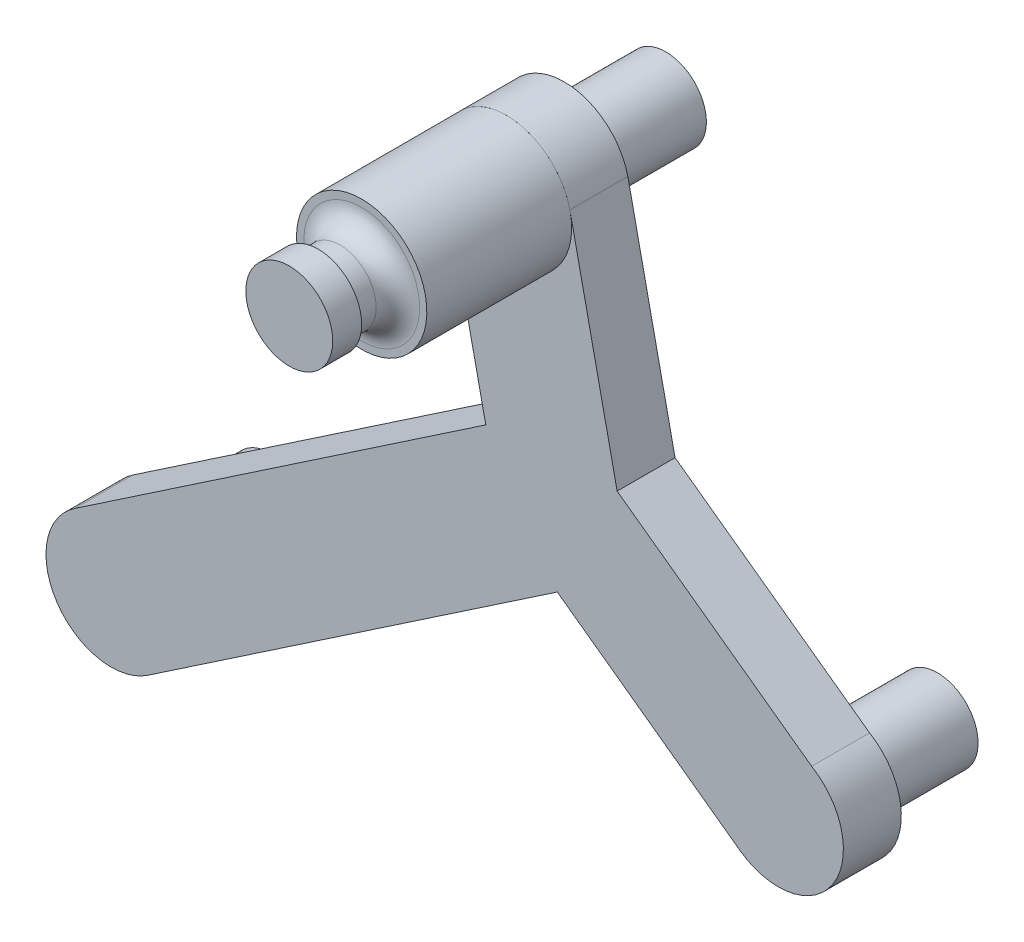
ISO-10303-21;
HEADER;
FILE_DESCRIPTION(('STEP AP214'),'2;1');
FILE_NAME('part.step','',(''),(''),'','','');
FILE_SCHEMA(('AUTOMOTIVE_DESIGN { 1 0 10303 214 1 1 1 1 }'));
ENDSEC;
DATA;
#1=APPLICATION_CONTEXT('core data for automotive mechanical design processes');
#2=APPLICATION_PROTOCOL_DEFINITION('international standard','automotive_design',2000,#1);
#3=PRODUCT_CONTEXT('',#1,'mechanical');
#4=PRODUCT('Part','Part','',(#3));
#5=PRODUCT_RELATED_PRODUCT_CATEGORY('part','',(#4));
#6=PRODUCT_DEFINITION_FORMATION('','',#4);
#7=PRODUCT_DEFINITION_CONTEXT('part definition',#1,'design');
#8=PRODUCT_DEFINITION('design','',#6,#7);
#9=PRODUCT_DEFINITION_SHAPE('','',#8);
#10=(LENGTH_UNIT() NAMED_UNIT(*) SI_UNIT(.MILLI.,.METRE.));
#11=(NAMED_UNIT(*) PLANE_ANGLE_UNIT() SI_UNIT($,.RADIAN.));
#12=(NAMED_UNIT(*) SI_UNIT($,.STERADIAN.) SOLID_ANGLE_UNIT());
#13=UNCERTAINTY_MEASURE_WITH_UNIT(LENGTH_MEASURE(1.E-05),#10,'distance_accuracy_value','');
#14=(GEOMETRIC_REPRESENTATION_CONTEXT(3) GLOBAL_UNCERTAINTY_ASSIGNED_CONTEXT((#13)) GLOBAL_UNIT_ASSIGNED_CONTEXT((#10,
#11,#12)) REPRESENTATION_CONTEXT('',''));
#15=CARTESIAN_POINT('',(0.,0.,0.));
#16=DIRECTION('',(0.,0.,1.));
#17=DIRECTION('',(1.,0.,0.));
#18=AXIS2_PLACEMENT_3D('',#15,#16,#17);
#19=CARTESIAN_POINT('',(0.,0.,4.));
#20=DIRECTION('',(0.,0.,1.));
#21=DIRECTION('',(1.,0.,0.));
#22=AXIS2_PLACEMENT_3D('',#19,#20,#21);
#23=PLANE('',#22);
#24=CARTESIAN_POINT('',(-3.59848546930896,16.7570367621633,4.));
#25=DIRECTION('',(0.,0.,1.));
#26=DIRECTION('',(1.,0.,0.));
#27=AXIS2_PLACEMENT_3D('',#24,#25,#26);
#28=CIRCLE('',#27,4.49893757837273);
#29=CARTESIAN_POINT('',(-7.9296622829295,15.539930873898,4.));
#30=VERTEX_POINT('',#29);
#31=CARTESIAN_POINT('',(0.80017246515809,17.7016254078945,4.));
#32=VERTEX_POINT('',#31);
#33=EDGE_CURVE('E48',#30,#32,#28,.T.);
#34=ORIENTED_EDGE('',*,*,#33,.F.);
#35=DIRECTION('',(-0.209958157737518,0.977710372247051,0.));
#36=VECTOR('',#35,1.);
#37=CARTESIAN_POINT('',(-4.39009341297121,-0.942749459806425,4.));
#38=LINE('',#37,#36);
#39=CARTESIAN_POINT('',(-5.02892290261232,2.03208240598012,4.));
#40=VERTEX_POINT('',#39);
#41=EDGE_CURVE('E206',#40,#30,#38,.T.);
#42=ORIENTED_EDGE('',*,*,#41,.F.);
#43=DIRECTION('',(0.828448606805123,0.560065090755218,0.));
#44=VECTOR('',#43,1.);
#45=CARTESIAN_POINT('',(-2.52029290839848,3.72801873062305,4.));
#46=LINE('',#45,#44);
#47=CARTESIAN_POINT('',(-33.4165334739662,-17.1591016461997,4.));
#48=VERTEX_POINT('',#47);
#49=EDGE_CURVE('E177',#48,#40,#46,.T.);
#50=ORIENTED_EDGE('',*,*,#49,.F.);
#51=CARTESIAN_POINT('',(-30.8962405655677,-20.8871203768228,4.));
#52=DIRECTION('',(0.,0.,1.));
#53=DIRECTION('',(1.,0.,0.));
#54=AXIS2_PLACEMENT_3D('',#51,#52,#53);
#55=CIRCLE('',#54,4.5);
#56=CARTESIAN_POINT('',(-28.3759476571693,-24.6151391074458,4.));
#57=VERTEX_POINT('',#56);
#58=EDGE_CURVE('E180',#48,#57,#55,.T.);
#59=ORIENTED_EDGE('',*,*,#58,.T.);
#60=DIRECTION('',(0.828448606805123,0.560065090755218,0.));
#61=VECTOR('',#60,1.);
#62=CARTESIAN_POINT('',(2.52029290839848,-3.72801873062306,4.));
#63=LINE('',#62,#61);
#64=CARTESIAN_POINT('',(-0.0904885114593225,-5.49301359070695,4.));
#65=VERTEX_POINT('',#64);
#66=EDGE_CURVE('E183',#57,#65,#63,.T.);
#67=ORIENTED_EDGE('',*,*,#66,.T.);
#68=DIRECTION('',(0.809551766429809,-0.587048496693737,0.));
#69=VECTOR('',#68,1.);
#70=CARTESIAN_POINT('',(-2.64171823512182,-3.64298294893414,4.));
#71=LINE('',#70,#69);
#72=CARTESIAN_POINT('',(12.521976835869,-14.6389745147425,4.));
#73=VERTEX_POINT('',#72);
#74=EDGE_CURVE('E185',#65,#73,#71,.T.);
#75=ORIENTED_EDGE('',*,*,#74,.T.);
#76=CARTESIAN_POINT('',(15.1636950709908,-10.9959915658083,4.));
#77=DIRECTION('',(0.,0.,1.));
#78=DIRECTION('',(1.,0.,0.));
#79=AXIS2_PLACEMENT_3D('',#76,#77,#78);
#80=CIRCLE('',#79,4.5);
#81=CARTESIAN_POINT('',(17.4737197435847,-7.13415443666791,4.));
#82=VERTEX_POINT('',#81);
#83=EDGE_CURVE('E187',#73,#82,#80,.T.);
#84=ORIENTED_EDGE('',*,*,#83,.T.);
#85=DIRECTION('',(0.809551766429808,-0.587048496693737,0.));
#86=VECTOR('',#85,1.);
#87=CARTESIAN_POINT('',(2.63141763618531,3.62877821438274,4.));
#88=LINE('',#87,#86);
#89=CARTESIAN_POINT('',(4.04188395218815,2.60597502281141,4.));
#90=VERTEX_POINT('',#89);
#91=EDGE_CURVE('E189',#90,#82,#88,.T.);
#92=ORIENTED_EDGE('',*,*,#91,.F.);
#93=DIRECTION('',(0.209958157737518,-0.977710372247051,0.));
#94=VECTOR('',#93,1.);
#95=CARTESIAN_POINT('',(4.39865793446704,0.944588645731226,4.));
#96=LINE('',#95,#94);
#97=EDGE_CURVE('E192',#32,#90,#96,.T.);
#98=ORIENTED_EDGE('',*,*,#97,.F.);
#99=EDGE_LOOP('',(#34,#42,#50,#59,#67,#75,#84,#92,#98));
#100=FACE_BOUND('',#99,.T.);
#101=ADVANCED_FACE('F33',(#100),#23,.T.);
#102=CARTESIAN_POINT('',(-30.8962405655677,-20.8871203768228,-7.));
#103=DIRECTION('',(0.,0.,1.));
#104=DIRECTION('',(1.,0.,0.));
#105=AXIS2_PLACEMENT_3D('',#102,#103,#104);
#106=CYLINDRICAL_SURFACE('',#105,4.5);
#107=CARTESIAN_POINT('',(-30.8962405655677,-20.8871203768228,0.));
#108=DIRECTION('',(0.,0.,1.));
#109=DIRECTION('',(1.,0.,0.));
#110=AXIS2_PLACEMENT_3D('',#107,#108,#109);
#111=CIRCLE('',#110,4.5);
#112=CARTESIAN_POINT('',(-28.3759476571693,-24.6151391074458,0.));
#113=VERTEX_POINT('',#112);
#114=CARTESIAN_POINT('',(-33.4165334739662,-17.1591016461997,0.));
#115=VERTEX_POINT('',#114);
#116=EDGE_CURVE('E137',#113,#115,#111,.F.);
#117=ORIENTED_EDGE('',*,*,#116,.F.);
#118=DIRECTION('',(0.,0.,-1.));
#119=VECTOR('',#118,1.);
#120=CARTESIAN_POINT('',(-28.3759476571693,-24.6151391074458,4.));
#121=LINE('',#120,#119);
#122=EDGE_CURVE('E223',#57,#113,#121,.T.);
#123=ORIENTED_EDGE('',*,*,#122,.F.);
#124=ORIENTED_EDGE('',*,*,#58,.F.);
#125=DIRECTION('',(0.,0.,-1.));
#126=VECTOR('',#125,1.);
#127=CARTESIAN_POINT('',(-33.4165334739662,-17.1591016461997,4.));
#128=LINE('',#127,#126);
#129=EDGE_CURVE('E226',#48,#115,#128,.T.);
#130=ORIENTED_EDGE('',*,*,#129,.T.);
#131=EDGE_LOOP('',(#117,#123,#124,#130));
#132=FACE_BOUND('',#131,.T.);
#133=ADVANCED_FACE('F275',(#132),#106,.T.);
#134=CARTESIAN_POINT('',(0.,0.,0.));
#135=DIRECTION('',(0.,0.,1.));
#136=DIRECTION('',(1.,0.,0.));
#137=AXIS2_PLACEMENT_3D('',#134,#135,#136);
#138=PLANE('',#137);
#139=DIRECTION('',(0.809551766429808,-0.587048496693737,0.));
#140=VECTOR('',#139,1.);
#141=CARTESIAN_POINT('',(2.63141763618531,3.62877821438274,0.));
#142=LINE('',#141,#140);
#143=CARTESIAN_POINT('',(4.04188395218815,2.60597502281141,0.));
#144=VERTEX_POINT('',#143);
#145=CARTESIAN_POINT('',(17.4737197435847,-7.13415443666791,0.));
#146=VERTEX_POINT('',#145);
#147=EDGE_CURVE('E211',#144,#146,#142,.T.);
#148=ORIENTED_EDGE('',*,*,#147,.T.);
#149=CARTESIAN_POINT('',(15.1636950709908,-10.9959915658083,0.));
#150=DIRECTION('',(0.,0.,1.));
#151=DIRECTION('',(1.,0.,0.));
#152=AXIS2_PLACEMENT_3D('',#149,#150,#151);
#153=CIRCLE('',#152,4.5);
#154=CARTESIAN_POINT('',(12.521976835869,-14.6389745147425,0.));
#155=VERTEX_POINT('',#154);
#156=EDGE_CURVE('E156',#146,#155,#153,.F.);
#157=ORIENTED_EDGE('',*,*,#156,.T.);
#158=DIRECTION('',(0.809551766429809,-0.587048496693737,0.));
#159=VECTOR('',#158,1.);
#160=CARTESIAN_POINT('',(-2.64171823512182,-3.64298294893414,0.));
#161=LINE('',#160,#159);
#162=CARTESIAN_POINT('',(-0.0904885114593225,-5.49301359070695,0.));
#163=VERTEX_POINT('',#162);
#164=EDGE_CURVE('E202',#163,#155,#161,.T.);
#165=ORIENTED_EDGE('',*,*,#164,.F.);
#166=DIRECTION('',(0.828448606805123,0.560065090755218,0.));
#167=VECTOR('',#166,1.);
#168=CARTESIAN_POINT('',(2.52029290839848,-3.72801873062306,0.));
#169=LINE('',#168,#167);
#170=EDGE_CURVE('E219',#113,#163,#169,.T.);
#171=ORIENTED_EDGE('',*,*,#170,.F.);
#172=ORIENTED_EDGE('',*,*,#116,.T.);
#173=DIRECTION('',(0.828448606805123,0.560065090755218,0.));
#174=VECTOR('',#173,1.);
#175=CARTESIAN_POINT('',(-2.52029290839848,3.72801873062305,0.));
#176=LINE('',#175,#174);
#177=CARTESIAN_POINT('',(-5.02892290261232,2.03208240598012,0.));
#178=VERTEX_POINT('',#177);
#179=EDGE_CURVE('E172',#115,#178,#176,.T.);
#180=ORIENTED_EDGE('',*,*,#179,.T.);
#181=DIRECTION('',(-0.209958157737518,0.977710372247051,0.));
#182=VECTOR('',#181,1.);
#183=CARTESIAN_POINT('',(-4.39009341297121,-0.942749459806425,0.));
#184=LINE('',#183,#182);
#185=CARTESIAN_POINT('',(-8.05096977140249,16.1048224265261,0.));
#186=VERTEX_POINT('',#185);
#187=EDGE_CURVE('E181',#178,#186,#184,.T.);
#188=ORIENTED_EDGE('',*,*,#187,.T.);
#189=CARTESIAN_POINT('',(-3.59848546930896,16.7570367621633,0.));
#190=DIRECTION('',(0.,0.,1.));
#191=DIRECTION('',(1.,0.,0.));
#192=AXIS2_PLACEMENT_3D('',#189,#190,#191);
#193=CIRCLE('',#192,4.5);
#194=CARTESIAN_POINT('',(0.779643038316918,17.7972246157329,0.));
#195=VERTEX_POINT('',#194);
#196=EDGE_CURVE('E164',#186,#195,#193,.F.);
#197=ORIENTED_EDGE('',*,*,#196,.T.);
#198=DIRECTION('',(-0.209958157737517,0.977710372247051,0.));
#199=VECTOR('',#198,1.);
#200=CARTESIAN_POINT('',(4.39865793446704,0.944588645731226,0.));
#201=LINE('',#200,#199);
#202=EDGE_CURVE('E209',#195,#144,#201,.F.);
#203=ORIENTED_EDGE('',*,*,#202,.T.);
#204=EDGE_LOOP('',(#148,#157,#165,#171,#172,#180,#188,#197,#203));
#205=FACE_BOUND('',#204,.T.);
#206=CARTESIAN_POINT('',(-3.59848546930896,16.7570367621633,0.));
#207=DIRECTION('',(0.,0.,1.));
#208=DIRECTION('',(1.,0.,0.));
#209=AXIS2_PLACEMENT_3D('',#206,#207,#208);
#210=CIRCLE('',#209,2.8);
#211=CARTESIAN_POINT('',(-6.39848546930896,16.7570367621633,0.));
#212=VERTEX_POINT('',#211);
#213=EDGE_CURVE('E169',#212,#212,#210,.F.);
#214=ORIENTED_EDGE('',*,*,#213,.F.);
#215=EDGE_LOOP('',(#214));
#216=FACE_BOUND('',#215,.T.);
#217=CARTESIAN_POINT('',(15.1636950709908,-10.9959915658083,0.));
#218=DIRECTION('',(0.,0.,1.));
#219=DIRECTION('',(1.,0.,0.));
#220=AXIS2_PLACEMENT_3D('',#217,#218,#219);
#221=CIRCLE('',#220,2.8);
#222=CARTESIAN_POINT('',(12.3636950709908,-10.9959915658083,0.));
#223=VERTEX_POINT('',#222);
#224=EDGE_CURVE('E161',#223,#223,#221,.F.);
#225=ORIENTED_EDGE('',*,*,#224,.F.);
#226=EDGE_LOOP('',(#225));
#227=FACE_BOUND('',#226,.T.);
#228=CARTESIAN_POINT('',(-30.8962405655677,-20.8871203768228,0.));
#229=DIRECTION('',(0.,0.,1.));
#230=DIRECTION('',(1.,0.,0.));
#231=AXIS2_PLACEMENT_3D('',#228,#229,#230);
#232=CIRCLE('',#231,2.8);
#233=CARTESIAN_POINT('',(-33.6962405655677,-20.8871203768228,0.));
#234=VERTEX_POINT('',#233);
#235=EDGE_CURVE('E152',#234,#234,#232,.F.);
#236=ORIENTED_EDGE('',*,*,#235,.F.);
#237=EDGE_LOOP('',(#236));
#238=FACE_BOUND('',#237,.T.);
#239=ADVANCED_FACE('F271',(#205,#216,#227,#238),#138,.F.);
#240=CARTESIAN_POINT('',(-2.52029290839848,3.72801873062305,4.));
#241=DIRECTION('',(-0.560065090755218,0.828448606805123,0.));
#242=DIRECTION('',(-0.828448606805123,-0.560065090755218,0.));
#243=AXIS2_PLACEMENT_3D('',#240,#241,#242);
#244=PLANE('',#243);
#245=ORIENTED_EDGE('',*,*,#179,.F.);
#246=ORIENTED_EDGE('',*,*,#129,.F.);
#247=ORIENTED_EDGE('',*,*,#49,.T.);
#248=DIRECTION('',(0.,0.,-1.));
#249=VECTOR('',#248,1.);
#250=CARTESIAN_POINT('',(-5.02892290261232,2.03208240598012,4.));
#251=LINE('',#250,#249);
#252=EDGE_CURVE('E208',#40,#178,#251,.T.);
#253=ORIENTED_EDGE('',*,*,#252,.T.);
#254=EDGE_LOOP('',(#245,#246,#247,#253));
#255=FACE_BOUND('',#254,.T.);
#256=ADVANCED_FACE('F277',(#255),#244,.T.);
#257=CARTESIAN_POINT('',(2.52029290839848,-3.72801873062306,4.));
#258=DIRECTION('',(-0.560065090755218,0.828448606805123,0.));
#259=DIRECTION('',(-0.828448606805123,-0.560065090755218,0.));
#260=AXIS2_PLACEMENT_3D('',#257,#258,#259);
#261=PLANE('',#260);
#262=ORIENTED_EDGE('',*,*,#170,.T.);
#263=DIRECTION('',(0.,0.,-1.));
#264=VECTOR('',#263,1.);
#265=CARTESIAN_POINT('',(-0.0904885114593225,-5.49301359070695,4.));
#266=LINE('',#265,#264);
#267=EDGE_CURVE('E227',#65,#163,#266,.T.);
#268=ORIENTED_EDGE('',*,*,#267,.F.);
#269=ORIENTED_EDGE('',*,*,#66,.F.);
#270=ORIENTED_EDGE('',*,*,#122,.T.);
#271=EDGE_LOOP('',(#262,#268,#269,#270));
#272=FACE_BOUND('',#271,.T.);
#273=ADVANCED_FACE('F270',(#272),#261,.F.);
#274=CARTESIAN_POINT('',(-2.64171823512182,-3.64298294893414,4.));
#275=DIRECTION('',(0.587048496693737,0.809551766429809,0.));
#276=DIRECTION('',(-0.809551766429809,0.587048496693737,0.));
#277=AXIS2_PLACEMENT_3D('',#274,#275,#276);
#278=PLANE('',#277);
#279=ORIENTED_EDGE('',*,*,#164,.T.);
#280=DIRECTION('',(0.,0.,-1.));
#281=VECTOR('',#280,1.);
#282=CARTESIAN_POINT('',(12.521976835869,-14.6389745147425,4.));
#283=LINE('',#282,#281);
#284=EDGE_CURVE('E238',#73,#155,#283,.T.);
#285=ORIENTED_EDGE('',*,*,#284,.F.);
#286=ORIENTED_EDGE('',*,*,#74,.F.);
#287=ORIENTED_EDGE('',*,*,#267,.T.);
#288=EDGE_LOOP('',(#279,#285,#286,#287));
#289=FACE_BOUND('',#288,.T.);
#290=ADVANCED_FACE('F256',(#289),#278,.F.);
#291=CARTESIAN_POINT('',(15.1636950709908,-10.9959915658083,4.));
#292=DIRECTION('',(0.,0.,-1.));
#293=DIRECTION('',(-1.,0.,0.));
#294=AXIS2_PLACEMENT_3D('',#291,#292,#293);
#295=CYLINDRICAL_SURFACE('',#294,4.5);
#296=ORIENTED_EDGE('',*,*,#284,.T.);
#297=ORIENTED_EDGE('',*,*,#156,.F.);
#298=DIRECTION('',(0.,0.,-1.));
#299=VECTOR('',#298,1.);
#300=CARTESIAN_POINT('',(17.4737197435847,-7.13415443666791,4.));
#301=LINE('',#300,#299);
#302=EDGE_CURVE('E241',#82,#146,#301,.T.);
#303=ORIENTED_EDGE('',*,*,#302,.F.);
#304=ORIENTED_EDGE('',*,*,#83,.F.);
#305=EDGE_LOOP('',(#296,#297,#303,#304));
#306=FACE_BOUND('',#305,.T.);
#307=ADVANCED_FACE('F262',(#306),#295,.T.);
#308=CARTESIAN_POINT('',(2.63141763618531,3.62877821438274,4.));
#309=DIRECTION('',(0.587048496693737,0.809551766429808,0.));
#310=DIRECTION('',(-0.809551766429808,0.587048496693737,0.));
#311=AXIS2_PLACEMENT_3D('',#308,#309,#310);
#312=PLANE('',#311);
#313=ORIENTED_EDGE('',*,*,#147,.F.);
#314=DIRECTION('',(0.,0.,-1.));
#315=VECTOR('',#314,1.);
#316=CARTESIAN_POINT('',(4.04188395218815,2.60597502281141,4.));
#317=LINE('',#316,#315);
#318=EDGE_CURVE('E215',#90,#144,#317,.T.);
#319=ORIENTED_EDGE('',*,*,#318,.F.);
#320=ORIENTED_EDGE('',*,*,#91,.T.);
#321=ORIENTED_EDGE('',*,*,#302,.T.);
#322=EDGE_LOOP('',(#313,#319,#320,#321));
#323=FACE_BOUND('',#322,.T.);
#324=ADVANCED_FACE('F288',(#323),#312,.T.);
#325=CARTESIAN_POINT('',(4.39865793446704,0.944588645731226,4.));
#326=DIRECTION('',(0.977710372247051,0.209958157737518,0.));
#327=DIRECTION('',(-0.209958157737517,0.977710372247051,0.));
#328=AXIS2_PLACEMENT_3D('',#325,#326,#327);
#329=PLANE('',#328);
#330=ORIENTED_EDGE('',*,*,#202,.F.);
#331=DIRECTION('',(0.,0.,-1.));
#332=VECTOR('',#331,1.);
#333=CARTESIAN_POINT('',(0.779643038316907,17.7972246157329,4.));
#334=LINE('',#333,#332);
#335=CARTESIAN_POINT('',(0.779643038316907,17.7972246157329,4.));
#336=VERTEX_POINT('',#335);
#337=EDGE_CURVE('E212',#336,#195,#334,.T.);
#338=ORIENTED_EDGE('',*,*,#337,.F.);
#339=EDGE_CURVE('E193',#336,#32,#96,.T.);
#340=ORIENTED_EDGE('',*,*,#339,.T.);
#341=ORIENTED_EDGE('',*,*,#97,.T.);
#342=ORIENTED_EDGE('',*,*,#318,.T.);
#343=EDGE_LOOP('',(#330,#338,#340,#341,#342));
#344=FACE_BOUND('',#343,.T.);
#345=ADVANCED_FACE('F285',(#344),#329,.T.);
#346=CARTESIAN_POINT('',(-3.59848546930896,16.7570367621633,4.));
#347=DIRECTION('',(0.,0.,-1.));
#348=DIRECTION('',(-1.,0.,0.));
#349=AXIS2_PLACEMENT_3D('',#346,#347,#348);
#350=CYLINDRICAL_SURFACE('',#349,4.5);
#351=ORIENTED_EDGE('',*,*,#337,.T.);
#352=ORIENTED_EDGE('',*,*,#196,.F.);
#353=DIRECTION('',(0.,0.,-1.));
#354=VECTOR('',#353,1.);
#355=CARTESIAN_POINT('',(-8.05096977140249,16.1048224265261,4.));
#356=LINE('',#355,#354);
#357=CARTESIAN_POINT('',(-8.05096977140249,16.1048224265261,4.));
#358=VERTEX_POINT('',#357);
#359=EDGE_CURVE('E216',#358,#186,#356,.T.);
#360=ORIENTED_EDGE('',*,*,#359,.F.);
#361=CARTESIAN_POINT('',(-3.59848546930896,16.7570367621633,4.));
#362=DIRECTION('',(0.,0.,1.));
#363=DIRECTION('',(1.,0.,0.));
#364=AXIS2_PLACEMENT_3D('',#361,#362,#363);
#365=CIRCLE('',#364,4.5);
#366=EDGE_CURVE('E196',#336,#358,#365,.T.);
#367=ORIENTED_EDGE('',*,*,#366,.F.);
#368=EDGE_LOOP('',(#351,#352,#360,#367));
#369=FACE_BOUND('',#368,.T.);
#370=ADVANCED_FACE('F281',(#369),#350,.T.);
#371=CARTESIAN_POINT('',(-4.39009341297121,-0.942749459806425,4.));
#372=DIRECTION('',(-0.977710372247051,-0.209958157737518,0.));
#373=DIRECTION('',(0.209958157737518,-0.977710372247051,0.));
#374=AXIS2_PLACEMENT_3D('',#371,#372,#373);
#375=PLANE('',#374);
#376=ORIENTED_EDGE('',*,*,#187,.F.);
#377=ORIENTED_EDGE('',*,*,#252,.F.);
#378=ORIENTED_EDGE('',*,*,#41,.T.);
#379=DIRECTION('',(0.,0.,-1.));
#380=VECTOR('',#379,1.);
#381=CARTESIAN_POINT('',(-7.9296622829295,15.539930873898,14.));
#382=LINE('',#381,#380);
#383=CARTESIAN_POINT('',(-7.9296622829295,15.539930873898,14.));
#384=VERTEX_POINT('',#383);
#385=EDGE_CURVE('E128',#384,#30,#382,.T.);
#386=ORIENTED_EDGE('',*,*,#385,.F.);
#387=DIRECTION('',(0.209958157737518,-0.977710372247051,0.));
#388=VECTOR('',#387,1.);
#389=CARTESIAN_POINT('',(-4.39009341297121,-0.942749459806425,14.));
#390=LINE('',#389,#388);
#391=CARTESIAN_POINT('',(-8.04749548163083,16.0886437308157,14.));
#392=VERTEX_POINT('',#391);
#393=EDGE_CURVE('E121',#392,#384,#390,.T.);
#394=ORIENTED_EDGE('',*,*,#393,.F.);
#395=DIRECTION('',(0.,0.,-1.));
#396=VECTOR('',#395,1.);
#397=CARTESIAN_POINT('',(-8.04749548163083,16.0886437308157,14.));
#398=LINE('',#397,#396);
#399=CARTESIAN_POINT('',(-8.04749548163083,16.0886437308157,4.));
#400=VERTEX_POINT('',#399);
#401=EDGE_CURVE('E126',#392,#400,#398,.T.);
#402=ORIENTED_EDGE('',*,*,#401,.T.);
#403=EDGE_CURVE('E199',#400,#358,#38,.T.);
#404=ORIENTED_EDGE('',*,*,#403,.T.);
#405=ORIENTED_EDGE('',*,*,#359,.T.);
#406=EDGE_LOOP('',(#376,#377,#378,#386,#394,#402,#404,#405));
#407=FACE_BOUND('',#406,.T.);
#408=ADVANCED_FACE('F124',(#407),#375,.T.);
#409=EDGE_CURVE('E56',#32,#400,#28,.T.);
#410=ORIENTED_EDGE('',*,*,#409,.F.);
#411=ORIENTED_EDGE('',*,*,#339,.F.);
#412=ORIENTED_EDGE('',*,*,#366,.T.);
#413=ORIENTED_EDGE('',*,*,#403,.F.);
#414=EDGE_LOOP('',(#410,#411,#412,#413));
#415=FACE_BOUND('',#414,.T.);
#416=ADVANCED_FACE('F300',(#415),#23,.T.);
#417=CARTESIAN_POINT('',(-3.59848546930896,16.7570367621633,12.7279220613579));
#418=DIRECTION('',(0.,0.,-1.));
#419=DIRECTION('',(-1.,0.,0.));
#420=AXIS2_PLACEMENT_3D('',#417,#418,#419);
#421=CYLINDRICAL_SURFACE('',#420,2.8);
#422=CARTESIAN_POINT('',(-3.59848546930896,16.7570367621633,-7.));
#423=DIRECTION('',(0.,0.,-1.));
#424=DIRECTION('',(-1.,0.,0.));
#425=AXIS2_PLACEMENT_3D('',#422,#423,#424);
#426=CIRCLE('',#425,2.8);
#427=CARTESIAN_POINT('',(-6.39848546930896,16.7570367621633,-7.));
#428=VERTEX_POINT('',#427);
#429=EDGE_CURVE('E173',#428,#428,#426,.T.);
#430=CARTESIAN_POINT('',(-6.39848546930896,16.7570367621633,-7.));
#431=CARTESIAN_POINT('',(-6.39848546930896,16.7570367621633,-6.92708333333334));
#432=CARTESIAN_POINT('',(-6.39848546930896,16.7570367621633,-6.85416666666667));
#433=CARTESIAN_POINT('',(-6.39848546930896,16.7570367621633,-6.70833333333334));
#434=CARTESIAN_POINT('',(-6.39848546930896,16.7570367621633,-6.63541666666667));
#435=CARTESIAN_POINT('',(-6.39848546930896,16.7570367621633,-6.48958333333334));
#436=CARTESIAN_POINT('',(-6.39848546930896,16.7570367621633,-6.41666666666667));
#437=CARTESIAN_POINT('',(-6.39848546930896,16.7570367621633,-6.27083333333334));
#438=CARTESIAN_POINT('',(-6.39848546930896,16.7570367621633,-6.19791666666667));
#439=CARTESIAN_POINT('',(-6.39848546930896,16.7570367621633,-6.05208333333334));
#440=CARTESIAN_POINT('',(-6.39848546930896,16.7570367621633,-5.97916666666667));
#441=CARTESIAN_POINT('',(-6.39848546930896,16.7570367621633,-5.83333333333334));
#442=CARTESIAN_POINT('',(-6.39848546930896,16.7570367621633,-5.76041666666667));
#443=CARTESIAN_POINT('',(-6.39848546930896,16.7570367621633,-5.61458333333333));
#444=CARTESIAN_POINT('',(-6.39848546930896,16.7570367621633,-5.54166666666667));
#445=CARTESIAN_POINT('',(-6.39848546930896,16.7570367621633,-5.39583333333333));
#446=CARTESIAN_POINT('',(-6.39848546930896,16.7570367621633,-5.32291666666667));
#447=CARTESIAN_POINT('',(-6.39848546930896,16.7570367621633,-5.17708333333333));
#448=CARTESIAN_POINT('',(-6.39848546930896,16.7570367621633,-5.10416666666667));
#449=CARTESIAN_POINT('',(-6.39848546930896,16.7570367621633,-4.95833333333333));
#450=CARTESIAN_POINT('',(-6.39848546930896,16.7570367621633,-4.88541666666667));
#451=CARTESIAN_POINT('',(-6.39848546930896,16.7570367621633,-4.73958333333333));
#452=CARTESIAN_POINT('',(-6.39848546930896,16.7570367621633,-4.66666666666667));
#453=CARTESIAN_POINT('',(-6.39848546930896,16.7570367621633,-4.52083333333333));
#454=CARTESIAN_POINT('',(-6.39848546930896,16.7570367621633,-4.44791666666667));
#455=CARTESIAN_POINT('',(-6.39848546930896,16.7570367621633,-4.30208333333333));
#456=CARTESIAN_POINT('',(-6.39848546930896,16.7570367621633,-4.22916666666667));
#457=CARTESIAN_POINT('',(-6.39848546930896,16.7570367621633,-4.08333333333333));
#458=CARTESIAN_POINT('',(-6.39848546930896,16.7570367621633,-4.01041666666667));
#459=CARTESIAN_POINT('',(-6.39848546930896,16.7570367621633,-3.86458333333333));
#460=CARTESIAN_POINT('',(-6.39848546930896,16.7570367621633,-3.79166666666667));
#461=CARTESIAN_POINT('',(-6.39848546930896,16.7570367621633,-3.64583333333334));
#462=CARTESIAN_POINT('',(-6.39848546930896,16.7570367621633,-3.57291666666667));
#463=CARTESIAN_POINT('',(-6.39848546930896,16.7570367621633,-3.42708333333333));
#464=CARTESIAN_POINT('',(-6.39848546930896,16.7570367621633,-3.35416666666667));
#465=CARTESIAN_POINT('',(-6.39848546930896,16.7570367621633,-3.20833333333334));
#466=CARTESIAN_POINT('',(-6.39848546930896,16.7570367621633,-3.13541666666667));
#467=CARTESIAN_POINT('',(-6.39848546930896,16.7570367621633,-2.98958333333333));
#468=CARTESIAN_POINT('',(-6.39848546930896,16.7570367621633,-2.91666666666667));
#469=CARTESIAN_POINT('',(-6.39848546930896,16.7570367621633,-2.77083333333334));
#470=CARTESIAN_POINT('',(-6.39848546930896,16.7570367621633,-2.69791666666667));
#471=CARTESIAN_POINT('',(-6.39848546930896,16.7570367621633,-2.55208333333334));
#472=CARTESIAN_POINT('',(-6.39848546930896,16.7570367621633,-2.47916666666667));
#473=CARTESIAN_POINT('',(-6.39848546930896,16.7570367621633,-2.33333333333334));
#474=CARTESIAN_POINT('',(-6.39848546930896,16.7570367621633,-2.26041666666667));
#475=CARTESIAN_POINT('',(-6.39848546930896,16.7570367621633,-2.11458333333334));
#476=CARTESIAN_POINT('',(-6.39848546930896,16.7570367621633,-2.04166666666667));
#477=CARTESIAN_POINT('',(-6.39848546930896,16.7570367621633,-1.89583333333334));
#478=CARTESIAN_POINT('',(-6.39848546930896,16.7570367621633,-1.82291666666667));
#479=CARTESIAN_POINT('',(-6.39848546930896,16.7570367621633,-1.67708333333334));
#480=CARTESIAN_POINT('',(-6.39848546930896,16.7570367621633,-1.60416666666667));
#481=CARTESIAN_POINT('',(-6.39848546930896,16.7570367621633,-1.45833333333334));
#482=CARTESIAN_POINT('',(-6.39848546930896,16.7570367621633,-1.38541666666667));
#483=CARTESIAN_POINT('',(-6.39848546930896,16.7570367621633,-1.23958333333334));
#484=CARTESIAN_POINT('',(-6.39848546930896,16.7570367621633,-1.16666666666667));
#485=CARTESIAN_POINT('',(-6.39848546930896,16.7570367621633,-1.02083333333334));
#486=CARTESIAN_POINT('',(-6.39848546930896,16.7570367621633,-0.947916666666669));
#487=CARTESIAN_POINT('',(-6.39848546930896,16.7570367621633,-0.802083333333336));
#488=CARTESIAN_POINT('',(-6.39848546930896,16.7570367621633,-0.729166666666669));
#489=CARTESIAN_POINT('',(-6.39848546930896,16.7570367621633,-0.583333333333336));
#490=CARTESIAN_POINT('',(-6.39848546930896,16.7570367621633,-0.510416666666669));
#491=CARTESIAN_POINT('',(-6.39848546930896,16.7570367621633,-0.364583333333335));
#492=CARTESIAN_POINT('',(-6.39848546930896,16.7570367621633,-0.291666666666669));
#493=CARTESIAN_POINT('',(-6.39848546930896,16.7570367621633,-0.145833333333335));
#494=CARTESIAN_POINT('',(-6.39848546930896,16.7570367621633,-0.0729166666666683));
#495=CARTESIAN_POINT('',(-6.39848546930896,16.7570367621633,0.));
#496=B_SPLINE_CURVE_WITH_KNOTS('',3,(#430,#431,#432,#433,#434,#435,#436,#437,#438,#439,#440,
#441,#442,#443,#444,#445,#446,#447,#448,#449,#450,#451,#452,#453,#454,#455,#456,#457,#458,#459,
#460,#461,#462,#463,#464,#465,#466,#467,#468,#469,#470,#471,#472,#473,#474,#475,#476,#477,#478,
#479,#480,#481,#482,#483,#484,#485,#486,#487,#488,#489,#490,#491,#492,#493,#494,#495),
.UNSPECIFIED.,.F.,.F.,(4,2,2,2,2,2,2,2,2,2,2,2,2,2,2,2,2,2,2,2,2,2,2,2,2,2,2,2,2,2,2,2,4),(0.,
0.21875,0.4375,0.656250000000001,0.875000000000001,1.09375,1.3125,1.53125,1.75,1.96875,2.1875,
2.40625,2.625,2.84375,3.0625,3.28125,3.5,3.71875,3.9375,4.15625,4.375,4.59375,4.8125,5.03125,
5.25,5.46875,5.6875,5.90625,6.125,6.34375,6.5625,6.78125,7.),.UNSPECIFIED.);
#497=EDGE_CURVE('BSEAM308',#428,#212,#496,.T.);
#498=ORIENTED_EDGE('',*,*,#429,.F.);
#499=ORIENTED_EDGE('',*,*,#213,.T.);
#500=ORIENTED_EDGE('',*,*,#497,.T.);
#501=ORIENTED_EDGE('',*,*,#497,.F.);
#502=EDGE_LOOP('',(#498,#500,#499,#501));
#503=FACE_BOUND('',#502,.T.);
#504=ADVANCED_FACE('F308',(#503),#421,.T.);
#505=CARTESIAN_POINT('',(-3.59848546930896,16.7570367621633,-7.));
#506=DIRECTION('',(0.,0.,1.));
#507=DIRECTION('',(1.,0.,0.));
#508=AXIS2_PLACEMENT_3D('',#505,#506,#507);
#509=PLANE('',#508);
#510=ORIENTED_EDGE('',*,*,#429,.T.);
#511=EDGE_LOOP('',(#510));
#512=FACE_BOUND('',#511,.T.);
#513=ADVANCED_FACE('F314',(#512),#509,.F.);
#514=CARTESIAN_POINT('',(15.1636950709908,-10.9959915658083,12.7279220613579));
#515=DIRECTION('',(0.,0.,-1.));
#516=DIRECTION('',(-1.,0.,0.));
#517=AXIS2_PLACEMENT_3D('',#514,#515,#516);
#518=CYLINDRICAL_SURFACE('',#517,2.8);
#519=CARTESIAN_POINT('',(15.1636950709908,-10.9959915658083,-7.));
#520=DIRECTION('',(0.,0.,-1.));
#521=DIRECTION('',(-1.,0.,0.));
#522=AXIS2_PLACEMENT_3D('',#519,#520,#521);
#523=CIRCLE('',#522,2.8);
#524=CARTESIAN_POINT('',(12.3636950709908,-10.9959915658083,-7.));
#525=VERTEX_POINT('',#524);
#526=EDGE_CURVE('E165',#525,#525,#523,.T.);
#527=CARTESIAN_POINT('',(12.3636950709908,-10.9959915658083,-7.));
#528=CARTESIAN_POINT('',(12.3636950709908,-10.9959915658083,-6.92708333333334));
#529=CARTESIAN_POINT('',(12.3636950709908,-10.9959915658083,-6.85416666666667));
#530=CARTESIAN_POINT('',(12.3636950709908,-10.9959915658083,-6.70833333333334));
#531=CARTESIAN_POINT('',(12.3636950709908,-10.9959915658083,-6.63541666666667));
#532=CARTESIAN_POINT('',(12.3636950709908,-10.9959915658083,-6.48958333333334));
#533=CARTESIAN_POINT('',(12.3636950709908,-10.9959915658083,-6.41666666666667));
#534=CARTESIAN_POINT('',(12.3636950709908,-10.9959915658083,-6.27083333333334));
#535=CARTESIAN_POINT('',(12.3636950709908,-10.9959915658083,-6.19791666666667));
#536=CARTESIAN_POINT('',(12.3636950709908,-10.9959915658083,-6.05208333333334));
#537=CARTESIAN_POINT('',(12.3636950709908,-10.9959915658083,-5.97916666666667));
#538=CARTESIAN_POINT('',(12.3636950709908,-10.9959915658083,-5.83333333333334));
#539=CARTESIAN_POINT('',(12.3636950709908,-10.9959915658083,-5.76041666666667));
#540=CARTESIAN_POINT('',(12.3636950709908,-10.9959915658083,-5.61458333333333));
#541=CARTESIAN_POINT('',(12.3636950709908,-10.9959915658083,-5.54166666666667));
#542=CARTESIAN_POINT('',(12.3636950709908,-10.9959915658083,-5.39583333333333));
#543=CARTESIAN_POINT('',(12.3636950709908,-10.9959915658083,-5.32291666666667));
#544=CARTESIAN_POINT('',(12.3636950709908,-10.9959915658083,-5.17708333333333));
#545=CARTESIAN_POINT('',(12.3636950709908,-10.9959915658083,-5.10416666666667));
#546=CARTESIAN_POINT('',(12.3636950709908,-10.9959915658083,-4.95833333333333));
#547=CARTESIAN_POINT('',(12.3636950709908,-10.9959915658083,-4.88541666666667));
#548=CARTESIAN_POINT('',(12.3636950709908,-10.9959915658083,-4.73958333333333));
#549=CARTESIAN_POINT('',(12.3636950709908,-10.9959915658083,-4.66666666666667));
#550=CARTESIAN_POINT('',(12.3636950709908,-10.9959915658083,-4.52083333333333));
#551=CARTESIAN_POINT('',(12.3636950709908,-10.9959915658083,-4.44791666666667));
#552=CARTESIAN_POINT('',(12.3636950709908,-10.9959915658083,-4.30208333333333));
#553=CARTESIAN_POINT('',(12.3636950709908,-10.9959915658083,-4.22916666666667));
#554=CARTESIAN_POINT('',(12.3636950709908,-10.9959915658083,-4.08333333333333));
#555=CARTESIAN_POINT('',(12.3636950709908,-10.9959915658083,-4.01041666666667));
#556=CARTESIAN_POINT('',(12.3636950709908,-10.9959915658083,-3.86458333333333));
#557=CARTESIAN_POINT('',(12.3636950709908,-10.9959915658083,-3.79166666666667));
#558=CARTESIAN_POINT('',(12.3636950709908,-10.9959915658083,-3.64583333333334));
#559=CARTESIAN_POINT('',(12.3636950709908,-10.9959915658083,-3.57291666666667));
#560=CARTESIAN_POINT('',(12.3636950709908,-10.9959915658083,-3.42708333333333));
#561=CARTESIAN_POINT('',(12.3636950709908,-10.9959915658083,-3.35416666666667));
#562=CARTESIAN_POINT('',(12.3636950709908,-10.9959915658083,-3.20833333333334));
#563=CARTESIAN_POINT('',(12.3636950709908,-10.9959915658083,-3.13541666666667));
#564=CARTESIAN_POINT('',(12.3636950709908,-10.9959915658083,-2.98958333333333));
#565=CARTESIAN_POINT('',(12.3636950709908,-10.9959915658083,-2.91666666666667));
#566=CARTESIAN_POINT('',(12.3636950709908,-10.9959915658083,-2.77083333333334));
#567=CARTESIAN_POINT('',(12.3636950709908,-10.9959915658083,-2.69791666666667));
#568=CARTESIAN_POINT('',(12.3636950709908,-10.9959915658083,-2.55208333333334));
#569=CARTESIAN_POINT('',(12.3636950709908,-10.9959915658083,-2.47916666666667));
#570=CARTESIAN_POINT('',(12.3636950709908,-10.9959915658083,-2.33333333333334));
#571=CARTESIAN_POINT('',(12.3636950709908,-10.9959915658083,-2.26041666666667));
#572=CARTESIAN_POINT('',(12.3636950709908,-10.9959915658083,-2.11458333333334));
#573=CARTESIAN_POINT('',(12.3636950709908,-10.9959915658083,-2.04166666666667));
#574=CARTESIAN_POINT('',(12.3636950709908,-10.9959915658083,-1.89583333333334));
#575=CARTESIAN_POINT('',(12.3636950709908,-10.9959915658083,-1.82291666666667));
#576=CARTESIAN_POINT('',(12.3636950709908,-10.9959915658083,-1.67708333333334));
#577=CARTESIAN_POINT('',(12.3636950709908,-10.9959915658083,-1.60416666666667));
#578=CARTESIAN_POINT('',(12.3636950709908,-10.9959915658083,-1.45833333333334));
#579=CARTESIAN_POINT('',(12.3636950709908,-10.9959915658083,-1.38541666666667));
#580=CARTESIAN_POINT('',(12.3636950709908,-10.9959915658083,-1.23958333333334));
#581=CARTESIAN_POINT('',(12.3636950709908,-10.9959915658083,-1.16666666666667));
#582=CARTESIAN_POINT('',(12.3636950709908,-10.9959915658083,-1.02083333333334));
#583=CARTESIAN_POINT('',(12.3636950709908,-10.9959915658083,-0.947916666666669));
#584=CARTESIAN_POINT('',(12.3636950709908,-10.9959915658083,-0.802083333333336));
#585=CARTESIAN_POINT('',(12.3636950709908,-10.9959915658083,-0.729166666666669));
#586=CARTESIAN_POINT('',(12.3636950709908,-10.9959915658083,-0.583333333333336));
#587=CARTESIAN_POINT('',(12.3636950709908,-10.9959915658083,-0.510416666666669));
#588=CARTESIAN_POINT('',(12.3636950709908,-10.9959915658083,-0.364583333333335));
#589=CARTESIAN_POINT('',(12.3636950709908,-10.9959915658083,-0.291666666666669));
#590=CARTESIAN_POINT('',(12.3636950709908,-10.9959915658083,-0.145833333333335));
#591=CARTESIAN_POINT('',(12.3636950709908,-10.9959915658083,-0.0729166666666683));
#592=CARTESIAN_POINT('',(12.3636950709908,-10.9959915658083,0.));
#593=B_SPLINE_CURVE_WITH_KNOTS('',3,(#527,#528,#529,#530,#531,#532,#533,#534,#535,#536,#537,
#538,#539,#540,#541,#542,#543,#544,#545,#546,#547,#548,#549,#550,#551,#552,#553,#554,#555,#556,
#557,#558,#559,#560,#561,#562,#563,#564,#565,#566,#567,#568,#569,#570,#571,#572,#573,#574,#575,
#576,#577,#578,#579,#580,#581,#582,#583,#584,#585,#586,#587,#588,#589,#590,#591,#592),
.UNSPECIFIED.,.F.,.F.,(4,2,2,2,2,2,2,2,2,2,2,2,2,2,2,2,2,2,2,2,2,2,2,2,2,2,2,2,2,2,2,2,4),(0.,
0.21875,0.4375,0.656250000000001,0.875000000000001,1.09375,1.3125,1.53125,1.75,1.96875,2.1875,
2.40625,2.625,2.84375,3.0625,3.28125,3.5,3.71875,3.9375,4.15625,4.375,4.59375,4.8125,5.03125,
5.25,5.46875,5.6875,5.90625,6.125,6.34375,6.5625,6.78125,7.),.UNSPECIFIED.);
#594=EDGE_CURVE('BSEAM352',#525,#223,#593,.T.);
#595=ORIENTED_EDGE('',*,*,#526,.F.);
#596=ORIENTED_EDGE('',*,*,#224,.T.);
#597=ORIENTED_EDGE('',*,*,#594,.T.);
#598=ORIENTED_EDGE('',*,*,#594,.F.);
#599=EDGE_LOOP('',(#595,#597,#596,#598));
#600=FACE_BOUND('',#599,.T.);
#601=ADVANCED_FACE('F352',(#600),#518,.T.);
#602=CARTESIAN_POINT('',(15.1636950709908,-10.9959915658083,-7.));
#603=DIRECTION('',(0.,0.,1.));
#604=DIRECTION('',(1.,0.,0.));
#605=AXIS2_PLACEMENT_3D('',#602,#603,#604);
#606=PLANE('',#605);
#607=ORIENTED_EDGE('',*,*,#526,.T.);
#608=EDGE_LOOP('',(#607));
#609=FACE_BOUND('',#608,.T.);
#610=ADVANCED_FACE('F342',(#609),#606,.F.);
#611=CARTESIAN_POINT('',(-30.8962405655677,-20.8871203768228,12.7279220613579));
#612=DIRECTION('',(0.,0.,-1.));
#613=DIRECTION('',(-1.,0.,0.));
#614=AXIS2_PLACEMENT_3D('',#611,#612,#613);
#615=CYLINDRICAL_SURFACE('',#614,2.8);
#616=CARTESIAN_POINT('',(-30.8962405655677,-20.8871203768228,-7.));
#617=DIRECTION('',(0.,0.,-1.));
#618=DIRECTION('',(-1.,0.,0.));
#619=AXIS2_PLACEMENT_3D('',#616,#617,#618);
#620=CIRCLE('',#619,2.8);
#621=CARTESIAN_POINT('',(-33.6962405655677,-20.8871203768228,-7.));
#622=VERTEX_POINT('',#621);
#623=EDGE_CURVE('E139',#622,#622,#620,.T.);
#624=CARTESIAN_POINT('',(-33.6962405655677,-20.8871203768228,-7.));
#625=CARTESIAN_POINT('',(-33.6962405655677,-20.8871203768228,-6.92708333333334));
#626=CARTESIAN_POINT('',(-33.6962405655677,-20.8871203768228,-6.85416666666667));
#627=CARTESIAN_POINT('',(-33.6962405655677,-20.8871203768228,-6.70833333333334));
#628=CARTESIAN_POINT('',(-33.6962405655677,-20.8871203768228,-6.63541666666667));
#629=CARTESIAN_POINT('',(-33.6962405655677,-20.8871203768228,-6.48958333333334));
#630=CARTESIAN_POINT('',(-33.6962405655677,-20.8871203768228,-6.41666666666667));
#631=CARTESIAN_POINT('',(-33.6962405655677,-20.8871203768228,-6.27083333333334));
#632=CARTESIAN_POINT('',(-33.6962405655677,-20.8871203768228,-6.19791666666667));
#633=CARTESIAN_POINT('',(-33.6962405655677,-20.8871203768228,-6.05208333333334));
#634=CARTESIAN_POINT('',(-33.6962405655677,-20.8871203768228,-5.97916666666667));
#635=CARTESIAN_POINT('',(-33.6962405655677,-20.8871203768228,-5.83333333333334));
#636=CARTESIAN_POINT('',(-33.6962405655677,-20.8871203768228,-5.76041666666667));
#637=CARTESIAN_POINT('',(-33.6962405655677,-20.8871203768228,-5.61458333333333));
#638=CARTESIAN_POINT('',(-33.6962405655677,-20.8871203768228,-5.54166666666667));
#639=CARTESIAN_POINT('',(-33.6962405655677,-20.8871203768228,-5.39583333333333));
#640=CARTESIAN_POINT('',(-33.6962405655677,-20.8871203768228,-5.32291666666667));
#641=CARTESIAN_POINT('',(-33.6962405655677,-20.8871203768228,-5.17708333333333));
#642=CARTESIAN_POINT('',(-33.6962405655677,-20.8871203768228,-5.10416666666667));
#643=CARTESIAN_POINT('',(-33.6962405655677,-20.8871203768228,-4.95833333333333));
#644=CARTESIAN_POINT('',(-33.6962405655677,-20.8871203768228,-4.88541666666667));
#645=CARTESIAN_POINT('',(-33.6962405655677,-20.8871203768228,-4.73958333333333));
#646=CARTESIAN_POINT('',(-33.6962405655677,-20.8871203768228,-4.66666666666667));
#647=CARTESIAN_POINT('',(-33.6962405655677,-20.8871203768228,-4.52083333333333));
#648=CARTESIAN_POINT('',(-33.6962405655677,-20.8871203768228,-4.44791666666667));
#649=CARTESIAN_POINT('',(-33.6962405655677,-20.8871203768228,-4.30208333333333));
#650=CARTESIAN_POINT('',(-33.6962405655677,-20.8871203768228,-4.22916666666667));
#651=CARTESIAN_POINT('',(-33.6962405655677,-20.8871203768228,-4.08333333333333));
#652=CARTESIAN_POINT('',(-33.6962405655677,-20.8871203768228,-4.01041666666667));
#653=CARTESIAN_POINT('',(-33.6962405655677,-20.8871203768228,-3.86458333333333));
#654=CARTESIAN_POINT('',(-33.6962405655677,-20.8871203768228,-3.79166666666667));
#655=CARTESIAN_POINT('',(-33.6962405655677,-20.8871203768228,-3.64583333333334));
#656=CARTESIAN_POINT('',(-33.6962405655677,-20.8871203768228,-3.57291666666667));
#657=CARTESIAN_POINT('',(-33.6962405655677,-20.8871203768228,-3.42708333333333));
#658=CARTESIAN_POINT('',(-33.6962405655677,-20.8871203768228,-3.35416666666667));
#659=CARTESIAN_POINT('',(-33.6962405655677,-20.8871203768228,-3.20833333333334));
#660=CARTESIAN_POINT('',(-33.6962405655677,-20.8871203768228,-3.13541666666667));
#661=CARTESIAN_POINT('',(-33.6962405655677,-20.8871203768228,-2.98958333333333));
#662=CARTESIAN_POINT('',(-33.6962405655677,-20.8871203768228,-2.91666666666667));
#663=CARTESIAN_POINT('',(-33.6962405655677,-20.8871203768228,-2.77083333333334));
#664=CARTESIAN_POINT('',(-33.6962405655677,-20.8871203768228,-2.69791666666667));
#665=CARTESIAN_POINT('',(-33.6962405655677,-20.8871203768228,-2.55208333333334));
#666=CARTESIAN_POINT('',(-33.6962405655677,-20.8871203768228,-2.47916666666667));
#667=CARTESIAN_POINT('',(-33.6962405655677,-20.8871203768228,-2.33333333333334));
#668=CARTESIAN_POINT('',(-33.6962405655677,-20.8871203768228,-2.26041666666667));
#669=CARTESIAN_POINT('',(-33.6962405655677,-20.8871203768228,-2.11458333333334));
#670=CARTESIAN_POINT('',(-33.6962405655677,-20.8871203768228,-2.04166666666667));
#671=CARTESIAN_POINT('',(-33.6962405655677,-20.8871203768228,-1.89583333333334));
#672=CARTESIAN_POINT('',(-33.6962405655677,-20.8871203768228,-1.82291666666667));
#673=CARTESIAN_POINT('',(-33.6962405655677,-20.8871203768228,-1.67708333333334));
#674=CARTESIAN_POINT('',(-33.6962405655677,-20.8871203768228,-1.60416666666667));
#675=CARTESIAN_POINT('',(-33.6962405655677,-20.8871203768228,-1.45833333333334));
#676=CARTESIAN_POINT('',(-33.6962405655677,-20.8871203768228,-1.38541666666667));
#677=CARTESIAN_POINT('',(-33.6962405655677,-20.8871203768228,-1.23958333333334));
#678=CARTESIAN_POINT('',(-33.6962405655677,-20.8871203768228,-1.16666666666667));
#679=CARTESIAN_POINT('',(-33.6962405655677,-20.8871203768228,-1.02083333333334));
#680=CARTESIAN_POINT('',(-33.6962405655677,-20.8871203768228,-0.947916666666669));
#681=CARTESIAN_POINT('',(-33.6962405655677,-20.8871203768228,-0.802083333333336));
#682=CARTESIAN_POINT('',(-33.6962405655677,-20.8871203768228,-0.729166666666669));
#683=CARTESIAN_POINT('',(-33.6962405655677,-20.8871203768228,-0.583333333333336));
#684=CARTESIAN_POINT('',(-33.6962405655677,-20.8871203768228,-0.510416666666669));
#685=CARTESIAN_POINT('',(-33.6962405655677,-20.8871203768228,-0.364583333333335));
#686=CARTESIAN_POINT('',(-33.6962405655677,-20.8871203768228,-0.291666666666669));
#687=CARTESIAN_POINT('',(-33.6962405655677,-20.8871203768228,-0.145833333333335));
#688=CARTESIAN_POINT('',(-33.6962405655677,-20.8871203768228,-0.0729166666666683));
#689=CARTESIAN_POINT('',(-33.6962405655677,-20.8871203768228,0.));
#690=B_SPLINE_CURVE_WITH_KNOTS('',3,(#624,#625,#626,#627,#628,#629,#630,#631,#632,#633,#634,
#635,#636,#637,#638,#639,#640,#641,#642,#643,#644,#645,#646,#647,#648,#649,#650,#651,#652,#653,
#654,#655,#656,#657,#658,#659,#660,#661,#662,#663,#664,#665,#666,#667,#668,#669,#670,#671,#672,
#673,#674,#675,#676,#677,#678,#679,#680,#681,#682,#683,#684,#685,#686,#687,#688,#689),
.UNSPECIFIED.,.F.,.F.,(4,2,2,2,2,2,2,2,2,2,2,2,2,2,2,2,2,2,2,2,2,2,2,2,2,2,2,2,2,2,2,2,4),(0.,
0.21875,0.4375,0.656250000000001,0.875000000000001,1.09375,1.3125,1.53125,1.75,1.96875,2.1875,
2.40625,2.625,2.84375,3.0625,3.28125,3.5,3.71875,3.9375,4.15625,4.375,4.59375,4.8125,5.03125,
5.25,5.46875,5.6875,5.90625,6.125,6.34375,6.5625,6.78125,7.),.UNSPECIFIED.);
#691=EDGE_CURVE('BSEAM337',#622,#234,#690,.T.);
#692=ORIENTED_EDGE('',*,*,#623,.F.);
#693=ORIENTED_EDGE('',*,*,#235,.T.);
#694=ORIENTED_EDGE('',*,*,#691,.T.);
#695=ORIENTED_EDGE('',*,*,#691,.F.);
#696=EDGE_LOOP('',(#692,#694,#693,#695));
#697=FACE_BOUND('',#696,.T.);
#698=ADVANCED_FACE('F337',(#697),#615,.T.);
#699=CARTESIAN_POINT('',(-30.8962405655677,-20.8871203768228,-7.));
#700=DIRECTION('',(0.,0.,1.));
#701=DIRECTION('',(1.,0.,0.));
#702=AXIS2_PLACEMENT_3D('',#699,#700,#701);
#703=PLANE('',#702);
#704=ORIENTED_EDGE('',*,*,#623,.T.);
#705=EDGE_LOOP('',(#704));
#706=FACE_BOUND('',#705,.T.);
#707=ADVANCED_FACE('F335',(#706),#703,.F.);
#708=CARTESIAN_POINT('',(-3.59848546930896,16.7570367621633,14.));
#709=DIRECTION('',(0.,0.,-1.));
#710=DIRECTION('',(-1.,0.,0.));
#711=AXIS2_PLACEMENT_3D('',#708,#709,#710);
#712=CYLINDRICAL_SURFACE('',#711,4.49893757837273);
#713=ORIENTED_EDGE('',*,*,#33,.T.);
#714=ORIENTED_EDGE('',*,*,#409,.T.);
#715=ORIENTED_EDGE('',*,*,#401,.F.);
#716=CARTESIAN_POINT('',(-3.59848546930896,16.7570367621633,14.));
#717=DIRECTION('',(0.,0.,1.));
#718=DIRECTION('',(1.,0.,0.));
#719=AXIS2_PLACEMENT_3D('',#716,#717,#718);
#720=CIRCLE('',#719,4.49893757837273);
#721=EDGE_CURVE('E131',#384,#392,#720,.T.);
#722=ORIENTED_EDGE('',*,*,#721,.F.);
#723=ORIENTED_EDGE('',*,*,#385,.T.);
#724=EDGE_LOOP('',(#713,#714,#715,#722,#723));
#725=FACE_BOUND('',#724,.T.);
#726=ADVANCED_FACE('F136',(#725),#712,.T.);
#727=CARTESIAN_POINT('',(0.,0.,14.));
#728=DIRECTION('',(0.,0.,1.));
#729=DIRECTION('',(1.,0.,0.));
#730=AXIS2_PLACEMENT_3D('',#727,#728,#729);
#731=PLANE('',#730);
#732=CARTESIAN_POINT('',(-3.59848546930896,16.7570367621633,14.));
#733=DIRECTION('',(0.,0.,1.));
#734=DIRECTION('',(1.,0.,0.));
#735=AXIS2_PLACEMENT_3D('',#732,#733,#734);
#736=CIRCLE('',#735,4.);
#737=CARTESIAN_POINT('',(0.401514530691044,16.7570367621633,14.));
#738=VERTEX_POINT('',#737);
#739=EDGE_CURVE('E41',#738,#738,#736,.F.);
#740=ORIENTED_EDGE('',*,*,#739,.T.);
#741=EDGE_LOOP('',(#740));
#742=FACE_BOUND('',#741,.T.);
#743=ORIENTED_EDGE('',*,*,#721,.T.);
#744=ORIENTED_EDGE('',*,*,#393,.T.);
#745=EDGE_LOOP('',(#743,#744));
#746=FACE_BOUND('',#745,.T.);
#747=ADVANCED_FACE('F133',(#742,#746),#731,.T.);
#748=CARTESIAN_POINT('',(-3.59848546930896,16.7570367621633,17.));
#749=DIRECTION('',(0.,0.,-1.));
#750=DIRECTION('',(-1.,0.,0.));
#751=AXIS2_PLACEMENT_3D('',#748,#749,#750);
#752=CYLINDRICAL_SURFACE('',#751,2.5);
#753=CARTESIAN_POINT('',(-3.59848546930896,16.7570367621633,15.5));
#754=DIRECTION('',(0.,0.,1.));
#755=DIRECTION('',(1.,0.,0.));
#756=AXIS2_PLACEMENT_3D('',#753,#754,#755);
#757=CIRCLE('',#756,2.5);
#758=CARTESIAN_POINT('',(-6.09848546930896,16.7570367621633,15.5));
#759=VERTEX_POINT('',#758);
#760=EDGE_CURVE('E11',#759,#759,#757,.T.);
#761=CARTESIAN_POINT('',(-3.59848546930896,16.7570367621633,17.));
#762=DIRECTION('',(0.,0.,1.));
#763=DIRECTION('',(1.,0.,0.));
#764=AXIS2_PLACEMENT_3D('',#761,#762,#763);
#765=CIRCLE('',#764,2.5);
#766=CARTESIAN_POINT('',(-6.09848546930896,16.7570367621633,17.));
#767=VERTEX_POINT('',#766);
#768=EDGE_CURVE('E148',#767,#767,#765,.T.);
#769=CARTESIAN_POINT('',(-6.09848546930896,16.7570367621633,15.5));
#770=CARTESIAN_POINT('',(-6.09848546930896,16.7570367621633,15.515625));
#771=CARTESIAN_POINT('',(-6.09848546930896,16.7570367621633,15.53125));
#772=CARTESIAN_POINT('',(-6.09848546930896,16.7570367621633,15.5625));
#773=CARTESIAN_POINT('',(-6.09848546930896,16.7570367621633,15.578125));
#774=CARTESIAN_POINT('',(-6.09848546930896,16.7570367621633,15.609375));
#775=CARTESIAN_POINT('',(-6.09848546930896,16.7570367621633,15.625));
#776=CARTESIAN_POINT('',(-6.09848546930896,16.7570367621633,15.65625));
#777=CARTESIAN_POINT('',(-6.09848546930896,16.7570367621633,15.671875));
#778=CARTESIAN_POINT('',(-6.09848546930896,16.7570367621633,15.703125));
#779=CARTESIAN_POINT('',(-6.09848546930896,16.7570367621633,15.71875));
#780=CARTESIAN_POINT('',(-6.09848546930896,16.7570367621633,15.75));
#781=CARTESIAN_POINT('',(-6.09848546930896,16.7570367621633,15.765625));
#782=CARTESIAN_POINT('',(-6.09848546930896,16.7570367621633,15.796875));
#783=CARTESIAN_POINT('',(-6.09848546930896,16.7570367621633,15.8125));
#784=CARTESIAN_POINT('',(-6.09848546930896,16.7570367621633,15.84375));
#785=CARTESIAN_POINT('',(-6.09848546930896,16.7570367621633,15.859375));
#786=CARTESIAN_POINT('',(-6.09848546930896,16.7570367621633,15.890625));
#787=CARTESIAN_POINT('',(-6.09848546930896,16.7570367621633,15.90625));
#788=CARTESIAN_POINT('',(-6.09848546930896,16.7570367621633,15.9375));
#789=CARTESIAN_POINT('',(-6.09848546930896,16.7570367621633,15.953125));
#790=CARTESIAN_POINT('',(-6.09848546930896,16.7570367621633,15.984375));
#791=CARTESIAN_POINT('',(-6.09848546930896,16.7570367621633,16.));
#792=CARTESIAN_POINT('',(-6.09848546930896,16.7570367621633,16.03125));
#793=CARTESIAN_POINT('',(-6.09848546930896,16.7570367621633,16.046875));
#794=CARTESIAN_POINT('',(-6.09848546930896,16.7570367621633,16.078125));
#795=CARTESIAN_POINT('',(-6.09848546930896,16.7570367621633,16.09375));
#796=CARTESIAN_POINT('',(-6.09848546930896,16.7570367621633,16.125));
#797=CARTESIAN_POINT('',(-6.09848546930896,16.7570367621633,16.140625));
#798=CARTESIAN_POINT('',(-6.09848546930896,16.7570367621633,16.171875));
#799=CARTESIAN_POINT('',(-6.09848546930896,16.7570367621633,16.1875));
#800=CARTESIAN_POINT('',(-6.09848546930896,16.7570367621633,16.21875));
#801=CARTESIAN_POINT('',(-6.09848546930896,16.7570367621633,16.234375));
#802=CARTESIAN_POINT('',(-6.09848546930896,16.7570367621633,16.265625));
#803=CARTESIAN_POINT('',(-6.09848546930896,16.7570367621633,16.28125));
#804=CARTESIAN_POINT('',(-6.09848546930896,16.7570367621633,16.3125));
#805=CARTESIAN_POINT('',(-6.09848546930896,16.7570367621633,16.328125));
#806=CARTESIAN_POINT('',(-6.09848546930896,16.7570367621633,16.359375));
#807=CARTESIAN_POINT('',(-6.09848546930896,16.7570367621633,16.375));
#808=CARTESIAN_POINT('',(-6.09848546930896,16.7570367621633,16.40625));
#809=CARTESIAN_POINT('',(-6.09848546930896,16.7570367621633,16.421875));
#810=CARTESIAN_POINT('',(-6.09848546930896,16.7570367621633,16.453125));
#811=CARTESIAN_POINT('',(-6.09848546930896,16.7570367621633,16.46875));
#812=CARTESIAN_POINT('',(-6.09848546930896,16.7570367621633,16.5));
#813=CARTESIAN_POINT('',(-6.09848546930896,16.7570367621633,16.515625));
#814=CARTESIAN_POINT('',(-6.09848546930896,16.7570367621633,16.546875));
#815=CARTESIAN_POINT('',(-6.09848546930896,16.7570367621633,16.5625));
#816=CARTESIAN_POINT('',(-6.09848546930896,16.7570367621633,16.59375));
#817=CARTESIAN_POINT('',(-6.09848546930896,16.7570367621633,16.609375));
#818=CARTESIAN_POINT('',(-6.09848546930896,16.7570367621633,16.640625));
#819=CARTESIAN_POINT('',(-6.09848546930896,16.7570367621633,16.65625));
#820=CARTESIAN_POINT('',(-6.09848546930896,16.7570367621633,16.6875));
#821=CARTESIAN_POINT('',(-6.09848546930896,16.7570367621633,16.703125));
#822=CARTESIAN_POINT('',(-6.09848546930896,16.7570367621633,16.734375));
#823=CARTESIAN_POINT('',(-6.09848546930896,16.7570367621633,16.75));
#824=CARTESIAN_POINT('',(-6.09848546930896,16.7570367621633,16.78125));
#825=CARTESIAN_POINT('',(-6.09848546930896,16.7570367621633,16.796875));
#826=CARTESIAN_POINT('',(-6.09848546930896,16.7570367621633,16.828125));
#827=CARTESIAN_POINT('',(-6.09848546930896,16.7570367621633,16.84375));
#828=CARTESIAN_POINT('',(-6.09848546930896,16.7570367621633,16.875));
#829=CARTESIAN_POINT('',(-6.09848546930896,16.7570367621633,16.890625));
#830=CARTESIAN_POINT('',(-6.09848546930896,16.7570367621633,16.921875));
#831=CARTESIAN_POINT('',(-6.09848546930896,16.7570367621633,16.9375));
#832=CARTESIAN_POINT('',(-6.09848546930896,16.7570367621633,16.96875));
#833=CARTESIAN_POINT('',(-6.09848546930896,16.7570367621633,16.984375));
#834=CARTESIAN_POINT('',(-6.09848546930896,16.7570367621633,17.));
#835=B_SPLINE_CURVE_WITH_KNOTS('',3,(#769,#770,#771,#772,#773,#774,#775,#776,#777,#778,#779,
#780,#781,#782,#783,#784,#785,#786,#787,#788,#789,#790,#791,#792,#793,#794,#795,#796,#797,#798,
#799,#800,#801,#802,#803,#804,#805,#806,#807,#808,#809,#810,#811,#812,#813,#814,#815,#816,#817,
#818,#819,#820,#821,#822,#823,#824,#825,#826,#827,#828,#829,#830,#831,#832,#833,#834),
.UNSPECIFIED.,.F.,.F.,(4,2,2,2,2,2,2,2,2,2,2,2,2,2,2,2,2,2,2,2,2,2,2,2,2,2,2,2,2,2,2,2,4),(0.,
0.046875,0.0937500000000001,0.140625,0.187500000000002,0.234375,0.281250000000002,0.328125,
0.375000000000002,0.421875,0.468750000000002,0.515625,0.562500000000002,0.609375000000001,
0.656250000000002,0.703125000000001,0.750000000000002,0.796875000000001,0.843750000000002,
0.890625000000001,0.937500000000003,0.984375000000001,1.03125,1.078125,1.125,1.171875,1.21875,
1.265625,1.3125,1.359375,1.40625,1.453125,1.5),.UNSPECIFIED.);
#836=EDGE_CURVE('BSEAM489',#759,#767,#835,.T.);
#837=ORIENTED_EDGE('',*,*,#760,.T.);
#838=ORIENTED_EDGE('',*,*,#768,.F.);
#839=ORIENTED_EDGE('',*,*,#836,.T.);
#840=ORIENTED_EDGE('',*,*,#836,.F.);
#841=EDGE_LOOP('',(#837,#839,#838,#840));
#842=FACE_BOUND('',#841,.T.);
#843=ADVANCED_FACE('F489',(#842),#752,.T.);
#844=CARTESIAN_POINT('',(-3.59848546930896,16.7570367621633,19.));
#845=DIRECTION('',(0.,0.,-1.));
#846=DIRECTION('',(-1.,0.,0.));
#847=AXIS2_PLACEMENT_3D('',#844,#845,#846);
#848=CYLINDRICAL_SURFACE('',#847,3.);
#849=CARTESIAN_POINT('',(-3.59848546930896,16.7570367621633,19.));
#850=DIRECTION('',(0.,0.,1.));
#851=DIRECTION('',(1.,0.,0.));
#852=AXIS2_PLACEMENT_3D('',#849,#850,#851);
#853=CIRCLE('',#852,3.);
#854=CARTESIAN_POINT('',(-0.598485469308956,16.7570367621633,19.));
#855=VERTEX_POINT('',#854);
#856=EDGE_CURVE('E547',#855,#855,#853,.T.);
#857=ORIENTED_EDGE('',*,*,#856,.F.);
#858=EDGE_LOOP('',(#857));
#859=FACE_BOUND('',#858,.T.);
#860=CARTESIAN_POINT('',(-3.59848546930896,16.7570367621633,17.));
#861=DIRECTION('',(0.,0.,1.));
#862=DIRECTION('',(1.,0.,0.));
#863=AXIS2_PLACEMENT_3D('',#860,#861,#862);
#864=CIRCLE('',#863,3.);
#865=CARTESIAN_POINT('',(-0.598485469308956,16.7570367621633,17.));
#866=VERTEX_POINT('',#865);
#867=EDGE_CURVE('E550',#866,#866,#864,.T.);
#868=ORIENTED_EDGE('',*,*,#867,.T.);
#869=EDGE_LOOP('',(#868));
#870=FACE_BOUND('',#869,.T.);
#871=ADVANCED_FACE('F498',(#859,#870),#848,.T.);
#872=CARTESIAN_POINT('',(-3.59848546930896,16.7570367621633,19.));
#873=DIRECTION('',(0.,0.,1.));
#874=DIRECTION('',(1.,0.,0.));
#875=AXIS2_PLACEMENT_3D('',#872,#873,#874);
#876=PLANE('',#875);
#877=ORIENTED_EDGE('',*,*,#856,.T.);
#878=EDGE_LOOP('',(#877));
#879=FACE_BOUND('',#878,.T.);
#880=ADVANCED_FACE('F507',(#879),#876,.T.);
#881=CARTESIAN_POINT('',(-3.59848546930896,16.7570367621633,17.));
#882=DIRECTION('',(0.,0.,1.));
#883=DIRECTION('',(1.,0.,0.));
#884=AXIS2_PLACEMENT_3D('',#881,#882,#883);
#885=PLANE('',#884);
#886=ORIENTED_EDGE('',*,*,#768,.T.);
#887=EDGE_LOOP('',(#886));
#888=FACE_BOUND('',#887,.T.);
#889=ORIENTED_EDGE('',*,*,#867,.F.);
#890=EDGE_LOOP('',(#889));
#891=FACE_BOUND('',#890,.T.);
#892=ADVANCED_FACE('F516',(#888,#891),#885,.F.);
#893=CARTESIAN_POINT('',(-3.59848546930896,16.7570367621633,15.5));
#894=DIRECTION('',(0.,0.,1.));
#895=DIRECTION('',(1.,0.,0.));
#896=AXIS2_PLACEMENT_3D('',#893,#894,#895);
#897=TOROIDAL_SURFACE('',#896,4.,1.5);
#898=ORIENTED_EDGE('',*,*,#760,.F.);
#899=EDGE_LOOP('',(#898));
#900=FACE_BOUND('',#899,.T.);
#901=ORIENTED_EDGE('',*,*,#739,.F.);
#902=EDGE_LOOP('',(#901));
#903=FACE_BOUND('',#902,.T.);
#904=ADVANCED_FACE('F35',(#900,#903),#897,.F.);
#905=CLOSED_SHELL('',(#101,#133,#239,#256,#273,#290,#307,#324,#345,#370,#408,#416,#504,#513,
#601,#610,#698,#707,#726,#747,#843,#871,#880,#892,#904));
#906=MANIFOLD_SOLID_BREP('B2',#905);
#907=ADVANCED_BREP_SHAPE_REPRESENTATION('',(#18,#906),#14);
#908=SHAPE_DEFINITION_REPRESENTATION(#9,#907);
ENDSEC;
END-ISO-10303-21;
